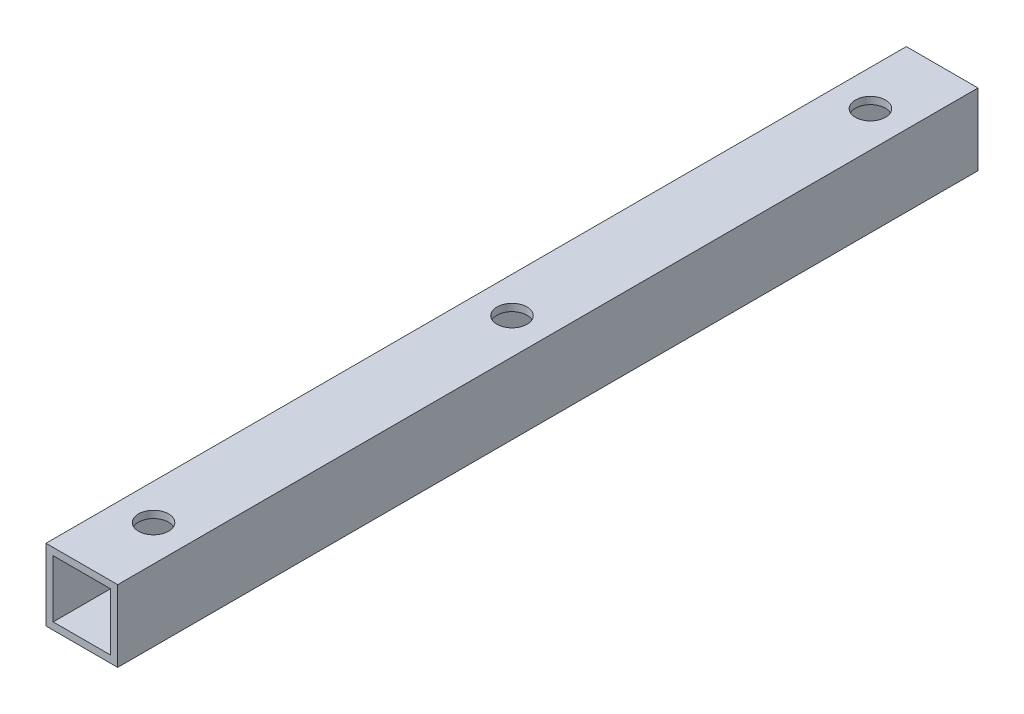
ISO-10303-21;
HEADER;
FILE_DESCRIPTION(('STEP AP214'),'2;1');
FILE_NAME('part.step','',(''),(''),'','','');
FILE_SCHEMA(('AUTOMOTIVE_DESIGN { 1 0 10303 214 1 1 1 1 }'));
ENDSEC;
DATA;
#1=APPLICATION_CONTEXT('core data for automotive mechanical design processes');
#2=APPLICATION_PROTOCOL_DEFINITION('international standard','automotive_design',2000,#1);
#3=PRODUCT_CONTEXT('',#1,'mechanical');
#4=PRODUCT('Part','Part','',(#3));
#5=PRODUCT_RELATED_PRODUCT_CATEGORY('part','',(#4));
#6=PRODUCT_DEFINITION_FORMATION('','',#4);
#7=PRODUCT_DEFINITION_CONTEXT('part definition',#1,'design');
#8=PRODUCT_DEFINITION('design','',#6,#7);
#9=PRODUCT_DEFINITION_SHAPE('','',#8);
#10=(LENGTH_UNIT() NAMED_UNIT(*) SI_UNIT(.MILLI.,.METRE.));
#11=(NAMED_UNIT(*) PLANE_ANGLE_UNIT() SI_UNIT($,.RADIAN.));
#12=(NAMED_UNIT(*) SI_UNIT($,.STERADIAN.) SOLID_ANGLE_UNIT());
#13=UNCERTAINTY_MEASURE_WITH_UNIT(LENGTH_MEASURE(1.E-05),#10,'distance_accuracy_value','');
#14=(GEOMETRIC_REPRESENTATION_CONTEXT(3) GLOBAL_UNCERTAINTY_ASSIGNED_CONTEXT((#13)) GLOBAL_UNIT_ASSIGNED_CONTEXT((#10,
#11,#12)) REPRESENTATION_CONTEXT('',''));
#15=CARTESIAN_POINT('',(0.,0.,0.));
#16=DIRECTION('',(0.,0.,1.));
#17=DIRECTION('',(1.,0.,0.));
#18=AXIS2_PLACEMENT_3D('',#15,#16,#17);
#19=CARTESIAN_POINT('',(-4.,-4.,120.));
#20=DIRECTION('',(0.,1.,0.));
#21=DIRECTION('',(1.,0.,0.));
#22=AXIS2_PLACEMENT_3D('',#19,#20,#21);
#23=PLANE('',#22);
#24=CARTESIAN_POINT('',(0.,-4.,10.));
#25=DIRECTION('',(0.,1.,0.));
#26=DIRECTION('',(-1.,0.,0.));
#27=AXIS2_PLACEMENT_3D('',#24,#25,#26);
#28=CIRCLE('',#27,2.1);
#29=CARTESIAN_POINT('',(-2.1,-4.,10.));
#30=VERTEX_POINT('',#29);
#31=EDGE_CURVE('E145',#30,#30,#28,.T.);
#32=ORIENTED_EDGE('',*,*,#31,.F.);
#33=EDGE_LOOP('',(#32));
#34=FACE_BOUND('',#33,.T.);
#35=CARTESIAN_POINT('',(0.,-4.,60.));
#36=DIRECTION('',(0.,1.,0.));
#37=DIRECTION('',(-1.,0.,0.));
#38=AXIS2_PLACEMENT_3D('',#35,#36,#37);
#39=CIRCLE('',#38,2.1);
#40=CARTESIAN_POINT('',(-2.1,-4.,60.));
#41=VERTEX_POINT('',#40);
#42=EDGE_CURVE('E197',#41,#41,#39,.T.);
#43=ORIENTED_EDGE('',*,*,#42,.F.);
#44=EDGE_LOOP('',(#43));
#45=FACE_BOUND('',#44,.T.);
#46=CARTESIAN_POINT('',(0.,-4.,110.));
#47=DIRECTION('',(0.,1.,0.));
#48=DIRECTION('',(-1.,0.,0.));
#49=AXIS2_PLACEMENT_3D('',#46,#47,#48);
#50=CIRCLE('',#49,2.1);
#51=CARTESIAN_POINT('',(-2.1,-4.,110.));
#52=VERTEX_POINT('',#51);
#53=EDGE_CURVE('E211',#52,#52,#50,.T.);
#54=ORIENTED_EDGE('',*,*,#53,.F.);
#55=EDGE_LOOP('',(#54));
#56=FACE_BOUND('',#55,.T.);
#57=DIRECTION('',(1.,0.,0.));
#58=VECTOR('',#57,1.);
#59=CARTESIAN_POINT('',(-4.,-4.,0.));
#60=LINE('',#59,#58);
#61=CARTESIAN_POINT('',(-4.,-4.,0.));
#62=VERTEX_POINT('',#61);
#63=CARTESIAN_POINT('',(4.,-4.,0.));
#64=VERTEX_POINT('',#63);
#65=EDGE_CURVE('E124',#62,#64,#60,.T.);
#66=ORIENTED_EDGE('',*,*,#65,.F.);
#67=DIRECTION('',(0.,0.,-1.));
#68=VECTOR('',#67,1.);
#69=CARTESIAN_POINT('',(-4.,-4.,120.));
#70=LINE('',#69,#68);
#71=CARTESIAN_POINT('',(-4.,-4.,120.));
#72=VERTEX_POINT('',#71);
#73=EDGE_CURVE('E11',#72,#62,#70,.T.);
#74=ORIENTED_EDGE('',*,*,#73,.F.);
#75=DIRECTION('',(1.,0.,0.));
#76=VECTOR('',#75,1.);
#77=CARTESIAN_POINT('',(-4.,-4.,120.));
#78=LINE('',#77,#76);
#79=CARTESIAN_POINT('',(4.,-4.,120.));
#80=VERTEX_POINT('',#79);
#81=EDGE_CURVE('E160',#72,#80,#78,.T.);
#82=ORIENTED_EDGE('',*,*,#81,.T.);
#83=DIRECTION('',(0.,0.,-1.));
#84=VECTOR('',#83,1.);
#85=CARTESIAN_POINT('',(4.,-4.,120.));
#86=LINE('',#85,#84);
#87=EDGE_CURVE('E177',#80,#64,#86,.T.);
#88=ORIENTED_EDGE('',*,*,#87,.T.);
#89=EDGE_LOOP('',(#66,#74,#82,#88));
#90=FACE_BOUND('',#89,.T.);
#91=ADVANCED_FACE('F17',(#34,#45,#56,#90),#23,.T.);
#92=CARTESIAN_POINT('',(-4.,-4.,120.));
#93=DIRECTION('',(1.,0.,0.));
#94=DIRECTION('',(0.,1.,0.));
#95=AXIS2_PLACEMENT_3D('',#92,#93,#94);
#96=PLANE('',#95);
#97=DIRECTION('',(0.,-1.,0.));
#98=VECTOR('',#97,1.);
#99=CARTESIAN_POINT('',(-4.,-4.,0.));
#100=LINE('',#99,#98);
#101=CARTESIAN_POINT('',(-4.,4.,0.));
#102=VERTEX_POINT('',#101);
#103=EDGE_CURVE('E176',#102,#62,#100,.T.);
#104=ORIENTED_EDGE('',*,*,#103,.F.);
#105=DIRECTION('',(0.,0.,-1.));
#106=VECTOR('',#105,1.);
#107=CARTESIAN_POINT('',(-4.,4.,120.));
#108=LINE('',#107,#106);
#109=CARTESIAN_POINT('',(-4.,4.,120.));
#110=VERTEX_POINT('',#109);
#111=EDGE_CURVE('E28',#110,#102,#108,.T.);
#112=ORIENTED_EDGE('',*,*,#111,.F.);
#113=DIRECTION('',(0.,-1.,0.));
#114=VECTOR('',#113,1.);
#115=CARTESIAN_POINT('',(-4.,-4.,120.));
#116=LINE('',#115,#114);
#117=EDGE_CURVE('E155',#110,#72,#116,.T.);
#118=ORIENTED_EDGE('',*,*,#117,.T.);
#119=ORIENTED_EDGE('',*,*,#73,.T.);
#120=EDGE_LOOP('',(#104,#112,#118,#119));
#121=FACE_BOUND('',#120,.T.);
#122=ADVANCED_FACE('F19',(#121),#96,.T.);
#123=CARTESIAN_POINT('',(-4.,4.,120.));
#124=DIRECTION('',(0.,-1.,0.));
#125=DIRECTION('',(0.,0.,-1.));
#126=AXIS2_PLACEMENT_3D('',#123,#124,#125);
#127=PLANE('',#126);
#128=CARTESIAN_POINT('',(0.,4.,10.));
#129=DIRECTION('',(0.,-1.,0.));
#130=DIRECTION('',(1.,0.,0.));
#131=AXIS2_PLACEMENT_3D('',#128,#129,#130);
#132=CIRCLE('',#131,2.1);
#133=CARTESIAN_POINT('',(2.1,4.,10.));
#134=VERTEX_POINT('',#133);
#135=EDGE_CURVE('E227',#134,#134,#132,.T.);
#136=ORIENTED_EDGE('',*,*,#135,.F.);
#137=EDGE_LOOP('',(#136));
#138=FACE_BOUND('',#137,.T.);
#139=CARTESIAN_POINT('',(0.,4.,60.));
#140=DIRECTION('',(0.,-1.,0.));
#141=DIRECTION('',(1.,0.,0.));
#142=AXIS2_PLACEMENT_3D('',#139,#140,#141);
#143=CIRCLE('',#142,2.1);
#144=CARTESIAN_POINT('',(2.1,4.,60.));
#145=VERTEX_POINT('',#144);
#146=EDGE_CURVE('E244',#145,#145,#143,.T.);
#147=ORIENTED_EDGE('',*,*,#146,.F.);
#148=EDGE_LOOP('',(#147));
#149=FACE_BOUND('',#148,.T.);
#150=CARTESIAN_POINT('',(0.,4.,110.));
#151=DIRECTION('',(0.,-1.,0.));
#152=DIRECTION('',(1.,0.,0.));
#153=AXIS2_PLACEMENT_3D('',#150,#151,#152);
#154=CIRCLE('',#153,2.1);
#155=CARTESIAN_POINT('',(2.1,4.,110.));
#156=VERTEX_POINT('',#155);
#157=EDGE_CURVE('E246',#156,#156,#154,.T.);
#158=ORIENTED_EDGE('',*,*,#157,.F.);
#159=EDGE_LOOP('',(#158));
#160=FACE_BOUND('',#159,.T.);
#161=DIRECTION('',(-1.,0.,0.));
#162=VECTOR('',#161,1.);
#163=CARTESIAN_POINT('',(-4.,4.,0.));
#164=LINE('',#163,#162);
#165=CARTESIAN_POINT('',(4.,4.,0.));
#166=VERTEX_POINT('',#165);
#167=EDGE_CURVE('E172',#166,#102,#164,.T.);
#168=ORIENTED_EDGE('',*,*,#167,.F.);
#169=DIRECTION('',(0.,0.,-1.));
#170=VECTOR('',#169,1.);
#171=CARTESIAN_POINT('',(4.,4.,120.));
#172=LINE('',#171,#170);
#173=CARTESIAN_POINT('',(4.,4.,120.));
#174=VERTEX_POINT('',#173);
#175=EDGE_CURVE('E21',#174,#166,#172,.T.);
#176=ORIENTED_EDGE('',*,*,#175,.F.);
#177=DIRECTION('',(-1.,0.,0.));
#178=VECTOR('',#177,1.);
#179=CARTESIAN_POINT('',(-4.,4.,120.));
#180=LINE('',#179,#178);
#181=EDGE_CURVE('E159',#174,#110,#180,.T.);
#182=ORIENTED_EDGE('',*,*,#181,.T.);
#183=ORIENTED_EDGE('',*,*,#111,.T.);
#184=EDGE_LOOP('',(#168,#176,#182,#183));
#185=FACE_BOUND('',#184,.T.);
#186=ADVANCED_FACE('F274',(#138,#149,#160,#185),#127,.T.);
#187=CARTESIAN_POINT('',(4.,-4.,120.));
#188=DIRECTION('',(-1.,0.,0.));
#189=DIRECTION('',(0.,0.,1.));
#190=AXIS2_PLACEMENT_3D('',#187,#188,#189);
#191=PLANE('',#190);
#192=DIRECTION('',(0.,1.,0.));
#193=VECTOR('',#192,1.);
#194=CARTESIAN_POINT('',(4.,-4.,0.));
#195=LINE('',#194,#193);
#196=EDGE_CURVE('E168',#64,#166,#195,.T.);
#197=ORIENTED_EDGE('',*,*,#196,.F.);
#198=ORIENTED_EDGE('',*,*,#87,.F.);
#199=DIRECTION('',(0.,1.,0.));
#200=VECTOR('',#199,1.);
#201=CARTESIAN_POINT('',(4.,-4.,120.));
#202=LINE('',#201,#200);
#203=EDGE_CURVE('E154',#80,#174,#202,.T.);
#204=ORIENTED_EDGE('',*,*,#203,.T.);
#205=ORIENTED_EDGE('',*,*,#175,.T.);
#206=EDGE_LOOP('',(#197,#198,#204,#205));
#207=FACE_BOUND('',#206,.T.);
#208=ADVANCED_FACE('F271',(#207),#191,.T.);
#209=CARTESIAN_POINT('',(-5.,-5.,120.));
#210=DIRECTION('',(0.,1.,0.));
#211=DIRECTION('',(1.,0.,0.));
#212=AXIS2_PLACEMENT_3D('',#209,#210,#211);
#213=PLANE('',#212);
#214=CARTESIAN_POINT('',(0.,-5.,10.));
#215=DIRECTION('',(0.,1.,0.));
#216=DIRECTION('',(0.,0.,1.));
#217=AXIS2_PLACEMENT_3D('',#214,#215,#216);
#218=CIRCLE('',#217,2.1);
#219=CARTESIAN_POINT('',(0.,-5.,12.1));
#220=VERTEX_POINT('',#219);
#221=EDGE_CURVE('E200',#220,#220,#218,.T.);
#222=ORIENTED_EDGE('',*,*,#221,.T.);
#223=EDGE_LOOP('',(#222));
#224=FACE_BOUND('',#223,.T.);
#225=CARTESIAN_POINT('',(0.,-5.,60.));
#226=DIRECTION('',(0.,1.,0.));
#227=DIRECTION('',(0.,0.,1.));
#228=AXIS2_PLACEMENT_3D('',#225,#226,#227);
#229=CIRCLE('',#228,2.1);
#230=CARTESIAN_POINT('',(0.,-5.,62.1));
#231=VERTEX_POINT('',#230);
#232=EDGE_CURVE('E201',#231,#231,#229,.T.);
#233=ORIENTED_EDGE('',*,*,#232,.T.);
#234=EDGE_LOOP('',(#233));
#235=FACE_BOUND('',#234,.T.);
#236=CARTESIAN_POINT('',(0.,-5.,110.));
#237=DIRECTION('',(0.,1.,0.));
#238=DIRECTION('',(0.,0.,1.));
#239=AXIS2_PLACEMENT_3D('',#236,#237,#238);
#240=CIRCLE('',#239,2.1);
#241=CARTESIAN_POINT('',(0.,-5.,112.1));
#242=VERTEX_POINT('',#241);
#243=EDGE_CURVE('E219',#242,#242,#240,.T.);
#244=ORIENTED_EDGE('',*,*,#243,.T.);
#245=EDGE_LOOP('',(#244));
#246=FACE_BOUND('',#245,.T.);
#247=DIRECTION('',(1.,0.,0.));
#248=VECTOR('',#247,1.);
#249=CARTESIAN_POINT('',(-5.,-5.,0.));
#250=LINE('',#249,#248);
#251=CARTESIAN_POINT('',(-5.,-5.,0.));
#252=VERTEX_POINT('',#251);
#253=CARTESIAN_POINT('',(5.,-5.,0.));
#254=VERTEX_POINT('',#253);
#255=EDGE_CURVE('E128',#252,#254,#250,.T.);
#256=ORIENTED_EDGE('',*,*,#255,.T.);
#257=DIRECTION('',(0.,0.,-1.));
#258=VECTOR('',#257,1.);
#259=CARTESIAN_POINT('',(5.,-5.,120.));
#260=LINE('',#259,#258);
#261=CARTESIAN_POINT('',(5.,-5.,120.));
#262=VERTEX_POINT('',#261);
#263=EDGE_CURVE('E114',#262,#254,#260,.T.);
#264=ORIENTED_EDGE('',*,*,#263,.F.);
#265=DIRECTION('',(1.,0.,0.));
#266=VECTOR('',#265,1.);
#267=CARTESIAN_POINT('',(-5.,-5.,120.));
#268=LINE('',#267,#266);
#269=CARTESIAN_POINT('',(-5.,-5.,120.));
#270=VERTEX_POINT('',#269);
#271=EDGE_CURVE('E150',#270,#262,#268,.T.);
#272=ORIENTED_EDGE('',*,*,#271,.F.);
#273=DIRECTION('',(0.,0.,-1.));
#274=VECTOR('',#273,1.);
#275=CARTESIAN_POINT('',(-5.,-5.,120.));
#276=LINE('',#275,#274);
#277=EDGE_CURVE('E113',#270,#252,#276,.T.);
#278=ORIENTED_EDGE('',*,*,#277,.T.);
#279=EDGE_LOOP('',(#256,#264,#272,#278));
#280=FACE_BOUND('',#279,.T.);
#281=ADVANCED_FACE('F190',(#224,#235,#246,#280),#213,.F.);
#282=CARTESIAN_POINT('',(-5.,-5.,120.));
#283=DIRECTION('',(1.,0.,0.));
#284=DIRECTION('',(0.,1.,0.));
#285=AXIS2_PLACEMENT_3D('',#282,#283,#284);
#286=PLANE('',#285);
#287=DIRECTION('',(0.,-1.,0.));
#288=VECTOR('',#287,1.);
#289=CARTESIAN_POINT('',(-5.,-5.,0.));
#290=LINE('',#289,#288);
#291=CARTESIAN_POINT('',(-5.,5.,0.));
#292=VERTEX_POINT('',#291);
#293=EDGE_CURVE('E105',#292,#252,#290,.T.);
#294=ORIENTED_EDGE('',*,*,#293,.T.);
#295=ORIENTED_EDGE('',*,*,#277,.F.);
#296=DIRECTION('',(0.,-1.,0.));
#297=VECTOR('',#296,1.);
#298=CARTESIAN_POINT('',(-5.,-5.,120.));
#299=LINE('',#298,#297);
#300=CARTESIAN_POINT('',(-5.,5.,120.));
#301=VERTEX_POINT('',#300);
#302=EDGE_CURVE('E108',#301,#270,#299,.T.);
#303=ORIENTED_EDGE('',*,*,#302,.F.);
#304=DIRECTION('',(0.,0.,-1.));
#305=VECTOR('',#304,1.);
#306=CARTESIAN_POINT('',(-5.,5.,120.));
#307=LINE('',#306,#305);
#308=EDGE_CURVE('E101',#301,#292,#307,.T.);
#309=ORIENTED_EDGE('',*,*,#308,.T.);
#310=EDGE_LOOP('',(#294,#295,#303,#309));
#311=FACE_BOUND('',#310,.T.);
#312=ADVANCED_FACE('F103',(#311),#286,.F.);
#313=CARTESIAN_POINT('',(-5.,5.,120.));
#314=DIRECTION('',(0.,-1.,0.));
#315=DIRECTION('',(0.,0.,-1.));
#316=AXIS2_PLACEMENT_3D('',#313,#314,#315);
#317=PLANE('',#316);
#318=CARTESIAN_POINT('',(0.,5.,10.));
#319=DIRECTION('',(0.,1.,0.));
#320=DIRECTION('',(0.,0.,1.));
#321=AXIS2_PLACEMENT_3D('',#318,#319,#320);
#322=CIRCLE('',#321,2.1);
#323=CARTESIAN_POINT('',(0.,5.,12.1));
#324=VERTEX_POINT('',#323);
#325=EDGE_CURVE('E224',#324,#324,#322,.T.);
#326=ORIENTED_EDGE('',*,*,#325,.F.);
#327=EDGE_LOOP('',(#326));
#328=FACE_BOUND('',#327,.T.);
#329=CARTESIAN_POINT('',(0.,5.,60.));
#330=DIRECTION('',(0.,1.,0.));
#331=DIRECTION('',(0.,0.,1.));
#332=AXIS2_PLACEMENT_3D('',#329,#330,#331);
#333=CIRCLE('',#332,2.1);
#334=CARTESIAN_POINT('',(0.,5.,62.1));
#335=VERTEX_POINT('',#334);
#336=EDGE_CURVE('E222',#335,#335,#333,.T.);
#337=ORIENTED_EDGE('',*,*,#336,.F.);
#338=EDGE_LOOP('',(#337));
#339=FACE_BOUND('',#338,.T.);
#340=CARTESIAN_POINT('',(0.,5.,110.));
#341=DIRECTION('',(0.,1.,0.));
#342=DIRECTION('',(0.,0.,1.));
#343=AXIS2_PLACEMENT_3D('',#340,#341,#342);
#344=CIRCLE('',#343,2.1);
#345=CARTESIAN_POINT('',(0.,5.,112.1));
#346=VERTEX_POINT('',#345);
#347=EDGE_CURVE('E248',#346,#346,#344,.T.);
#348=ORIENTED_EDGE('',*,*,#347,.F.);
#349=EDGE_LOOP('',(#348));
#350=FACE_BOUND('',#349,.T.);
#351=DIRECTION('',(-1.,0.,0.));
#352=VECTOR('',#351,1.);
#353=CARTESIAN_POINT('',(-5.,5.,0.));
#354=LINE('',#353,#352);
#355=CARTESIAN_POINT('',(5.,5.,0.));
#356=VERTEX_POINT('',#355);
#357=EDGE_CURVE('E117',#356,#292,#354,.T.);
#358=ORIENTED_EDGE('',*,*,#357,.T.);
#359=ORIENTED_EDGE('',*,*,#308,.F.);
#360=DIRECTION('',(-1.,0.,0.));
#361=VECTOR('',#360,1.);
#362=CARTESIAN_POINT('',(-5.,5.,120.));
#363=LINE('',#362,#361);
#364=CARTESIAN_POINT('',(5.,5.,120.));
#365=VERTEX_POINT('',#364);
#366=EDGE_CURVE('E144',#365,#301,#363,.T.);
#367=ORIENTED_EDGE('',*,*,#366,.F.);
#368=DIRECTION('',(0.,0.,-1.));
#369=VECTOR('',#368,1.);
#370=CARTESIAN_POINT('',(5.,5.,120.));
#371=LINE('',#370,#369);
#372=EDGE_CURVE('E119',#365,#356,#371,.T.);
#373=ORIENTED_EDGE('',*,*,#372,.T.);
#374=EDGE_LOOP('',(#358,#359,#367,#373));
#375=FACE_BOUND('',#374,.T.);
#376=ADVANCED_FACE('F118',(#328,#339,#350,#375),#317,.F.);
#377=CARTESIAN_POINT('',(5.,-5.,120.));
#378=DIRECTION('',(-1.,0.,0.));
#379=DIRECTION('',(0.,0.,1.));
#380=AXIS2_PLACEMENT_3D('',#377,#378,#379);
#381=PLANE('',#380);
#382=DIRECTION('',(0.,1.,0.));
#383=VECTOR('',#382,1.);
#384=CARTESIAN_POINT('',(5.,-5.,0.));
#385=LINE('',#384,#383);
#386=EDGE_CURVE('E135',#254,#356,#385,.T.);
#387=ORIENTED_EDGE('',*,*,#386,.T.);
#388=ORIENTED_EDGE('',*,*,#372,.F.);
#389=DIRECTION('',(0.,1.,0.));
#390=VECTOR('',#389,1.);
#391=CARTESIAN_POINT('',(5.,-5.,120.));
#392=LINE('',#391,#390);
#393=EDGE_CURVE('E140',#262,#365,#392,.T.);
#394=ORIENTED_EDGE('',*,*,#393,.F.);
#395=ORIENTED_EDGE('',*,*,#263,.T.);
#396=EDGE_LOOP('',(#387,#388,#394,#395));
#397=FACE_BOUND('',#396,.T.);
#398=ADVANCED_FACE('F187',(#397),#381,.F.);
#399=CARTESIAN_POINT('',(0.,0.,0.));
#400=DIRECTION('',(0.,0.,-1.));
#401=DIRECTION('',(0.,-1.,0.));
#402=AXIS2_PLACEMENT_3D('',#399,#400,#401);
#403=PLANE('',#402);
#404=ORIENTED_EDGE('',*,*,#65,.T.);
#405=ORIENTED_EDGE('',*,*,#196,.T.);
#406=ORIENTED_EDGE('',*,*,#167,.T.);
#407=ORIENTED_EDGE('',*,*,#103,.T.);
#408=EDGE_LOOP('',(#404,#405,#406,#407));
#409=FACE_BOUND('',#408,.T.);
#410=ORIENTED_EDGE('',*,*,#386,.F.);
#411=ORIENTED_EDGE('',*,*,#255,.F.);
#412=ORIENTED_EDGE('',*,*,#293,.F.);
#413=ORIENTED_EDGE('',*,*,#357,.F.);
#414=EDGE_LOOP('',(#410,#411,#412,#413));
#415=FACE_BOUND('',#414,.T.);
#416=ADVANCED_FACE('F126',(#409,#415),#403,.T.);
#417=CARTESIAN_POINT('',(0.,0.,120.));
#418=DIRECTION('',(0.,0.,-1.));
#419=DIRECTION('',(0.,-1.,0.));
#420=AXIS2_PLACEMENT_3D('',#417,#418,#419);
#421=PLANE('',#420);
#422=ORIENTED_EDGE('',*,*,#203,.F.);
#423=ORIENTED_EDGE('',*,*,#81,.F.);
#424=ORIENTED_EDGE('',*,*,#117,.F.);
#425=ORIENTED_EDGE('',*,*,#181,.F.);
#426=EDGE_LOOP('',(#422,#423,#424,#425));
#427=FACE_BOUND('',#426,.T.);
#428=ORIENTED_EDGE('',*,*,#393,.T.);
#429=ORIENTED_EDGE('',*,*,#366,.T.);
#430=ORIENTED_EDGE('',*,*,#302,.T.);
#431=ORIENTED_EDGE('',*,*,#271,.T.);
#432=EDGE_LOOP('',(#428,#429,#430,#431));
#433=FACE_BOUND('',#432,.T.);
#434=ADVANCED_FACE('F304',(#427,#433),#421,.F.);
#435=CARTESIAN_POINT('',(0.,-115.,10.));
#436=DIRECTION('',(0.,1.,0.));
#437=DIRECTION('',(0.,0.,1.));
#438=AXIS2_PLACEMENT_3D('',#435,#436,#437);
#439=CYLINDRICAL_SURFACE('',#438,2.1);
#440=ORIENTED_EDGE('',*,*,#31,.T.);
#441=EDGE_LOOP('',(#440));
#442=FACE_BOUND('',#441,.T.);
#443=ORIENTED_EDGE('',*,*,#221,.F.);
#444=EDGE_LOOP('',(#443));
#445=FACE_BOUND('',#444,.T.);
#446=ADVANCED_FACE('F302',(#442,#445),#439,.F.);
#447=CARTESIAN_POINT('',(0.,-115.,60.));
#448=DIRECTION('',(0.,1.,0.));
#449=DIRECTION('',(0.,0.,1.));
#450=AXIS2_PLACEMENT_3D('',#447,#448,#449);
#451=CYLINDRICAL_SURFACE('',#450,2.1);
#452=ORIENTED_EDGE('',*,*,#42,.T.);
#453=EDGE_LOOP('',(#452));
#454=FACE_BOUND('',#453,.T.);
#455=ORIENTED_EDGE('',*,*,#232,.F.);
#456=EDGE_LOOP('',(#455));
#457=FACE_BOUND('',#456,.T.);
#458=ADVANCED_FACE('F299',(#454,#457),#451,.F.);
#459=CARTESIAN_POINT('',(0.,-115.,110.));
#460=DIRECTION('',(0.,1.,0.));
#461=DIRECTION('',(0.,0.,1.));
#462=AXIS2_PLACEMENT_3D('',#459,#460,#461);
#463=CYLINDRICAL_SURFACE('',#462,2.1);
#464=ORIENTED_EDGE('',*,*,#53,.T.);
#465=EDGE_LOOP('',(#464));
#466=FACE_BOUND('',#465,.T.);
#467=ORIENTED_EDGE('',*,*,#243,.F.);
#468=EDGE_LOOP('',(#467));
#469=FACE_BOUND('',#468,.T.);
#470=ADVANCED_FACE('F301',(#466,#469),#463,.F.);
#471=CARTESIAN_POINT('',(0.,-115.,10.));
#472=DIRECTION('',(0.,1.,0.));
#473=DIRECTION('',(0.,0.,1.));
#474=AXIS2_PLACEMENT_3D('',#471,#472,#473);
#475=CYLINDRICAL_SURFACE('',#474,2.1);
#476=ORIENTED_EDGE('',*,*,#325,.T.);
#477=EDGE_LOOP('',(#476));
#478=FACE_BOUND('',#477,.T.);
#479=ORIENTED_EDGE('',*,*,#135,.T.);
#480=EDGE_LOOP('',(#479));
#481=FACE_BOUND('',#480,.T.);
#482=ADVANCED_FACE('F297',(#478,#481),#475,.F.);
#483=CARTESIAN_POINT('',(0.,-115.,60.));
#484=DIRECTION('',(0.,1.,0.));
#485=DIRECTION('',(0.,0.,1.));
#486=AXIS2_PLACEMENT_3D('',#483,#484,#485);
#487=CYLINDRICAL_SURFACE('',#486,2.1);
#488=ORIENTED_EDGE('',*,*,#336,.T.);
#489=EDGE_LOOP('',(#488));
#490=FACE_BOUND('',#489,.T.);
#491=ORIENTED_EDGE('',*,*,#146,.T.);
#492=EDGE_LOOP('',(#491));
#493=FACE_BOUND('',#492,.T.);
#494=ADVANCED_FACE('F324',(#490,#493),#487,.F.);
#495=CARTESIAN_POINT('',(0.,-115.,110.));
#496=DIRECTION('',(0.,1.,0.));
#497=DIRECTION('',(0.,0.,1.));
#498=AXIS2_PLACEMENT_3D('',#495,#496,#497);
#499=CYLINDRICAL_SURFACE('',#498,2.1);
#500=ORIENTED_EDGE('',*,*,#347,.T.);
#501=EDGE_LOOP('',(#500));
#502=FACE_BOUND('',#501,.T.);
#503=ORIENTED_EDGE('',*,*,#157,.T.);
#504=EDGE_LOOP('',(#503));
#505=FACE_BOUND('',#504,.T.);
#506=ADVANCED_FACE('F328',(#502,#505),#499,.F.);
#507=CLOSED_SHELL('',(#91,#122,#186,#208,#281,#312,#376,#398,#416,#434,#446,#458,#470,#482,#494,#506));
#508=MANIFOLD_SOLID_BREP('B1',#507);
#509=ADVANCED_BREP_SHAPE_REPRESENTATION('',(#18,#508),#14);
#510=SHAPE_DEFINITION_REPRESENTATION(#9,#509);
ENDSEC;
END-ISO-10303-21;
